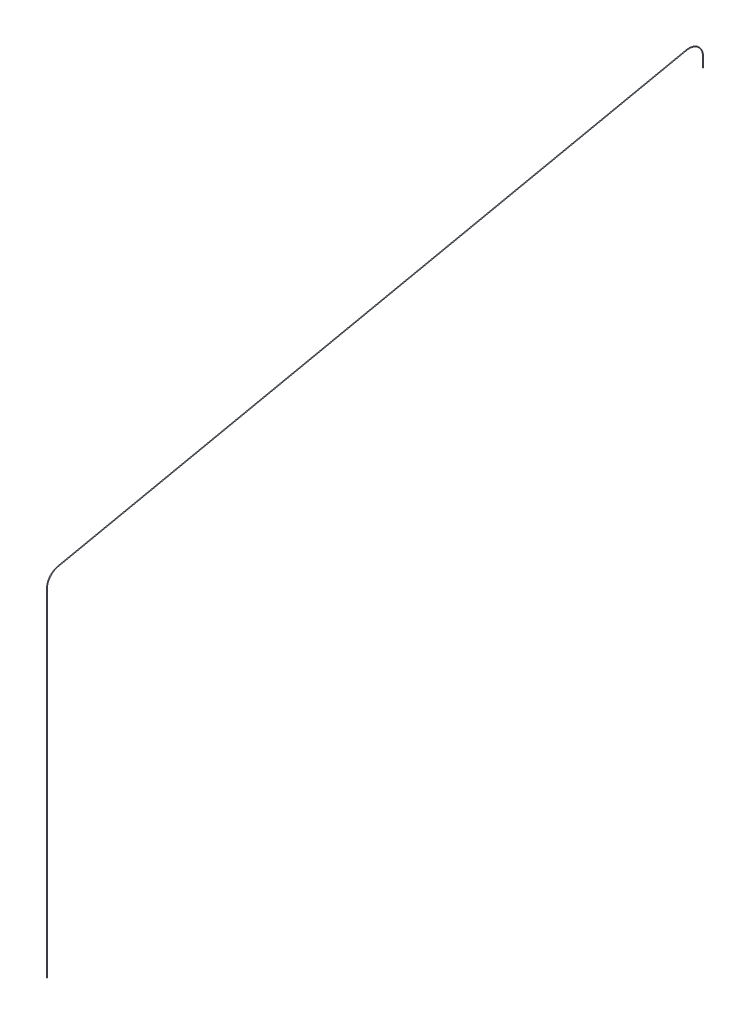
from build123d import *

# Parameters (mm, degrees)
SKETCH3_R = 9.5


with BuildPart() as part:
    # Sweep1: sweep along a path in Sketch2
    with BuildLine(Plane(origin=(0, 0, 0), x_dir=(0, 0, -1), z_dir=(1, 0, 0))) as sweep1_path:
        Line((-416.2, -10000), (-416.2, 0))
        ThreePointArc((-416.2, 0), (-323.296592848, 262.110192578), (-86.061830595, 407.204864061))
        Line((-86.061830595, 407.204864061), (18546.386305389, 4345.130799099))
        ThreePointArc((18546.386305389, 4345.130799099), (18893.554468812, 4261.464454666), (19047.2, 3939.1))
        Line((19047.2, 3939.1), (19047.2, 3645.121522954))
    # Sketch3 → Sweep1 (sweep)
    with BuildSketch(Plane(origin=(0, -10000, 0), x_dir=(1, 0, 0), z_dir=(0, 1, 0))):
        with Locations((0, -416.2)):
            Circle(SKETCH3_R)
    sweep(path=sweep1_path.line)


solid = part.part
